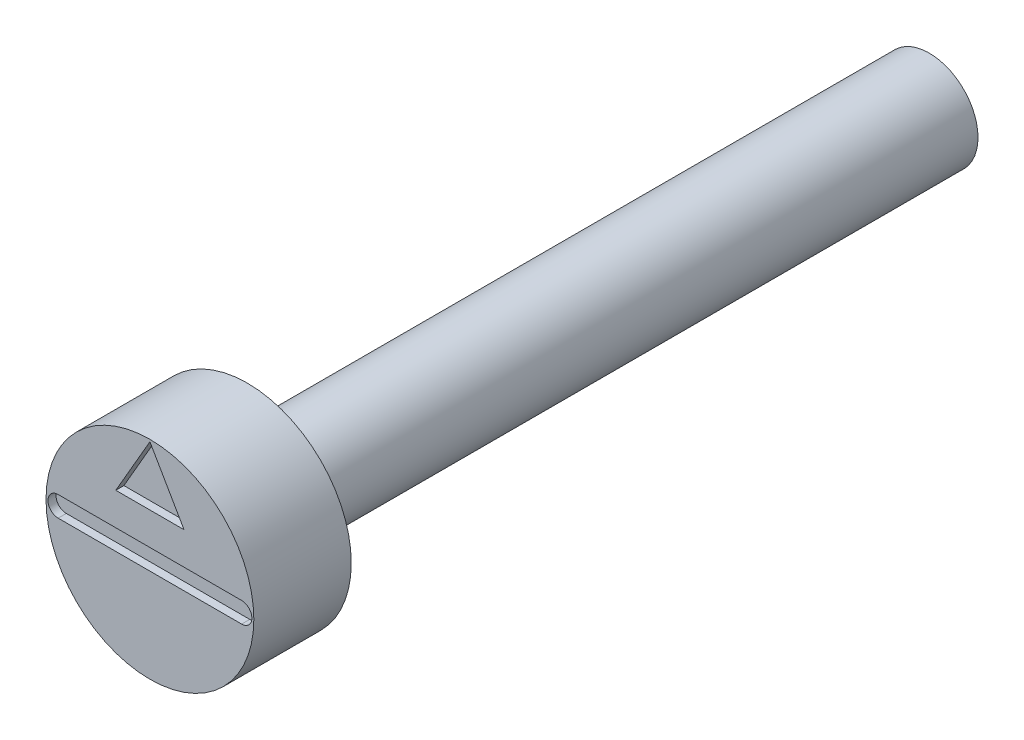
ISO-10303-21;
HEADER;
FILE_DESCRIPTION(('STEP AP214'),'2;1');
FILE_NAME('part.step','',(''),(''),'','','');
FILE_SCHEMA(('AUTOMOTIVE_DESIGN { 1 0 10303 214 1 1 1 1 }'));
ENDSEC;
DATA;
#1=APPLICATION_CONTEXT('core data for automotive mechanical design processes');
#2=APPLICATION_PROTOCOL_DEFINITION('international standard','automotive_design',2000,#1);
#3=PRODUCT_CONTEXT('',#1,'mechanical');
#4=PRODUCT('Part','Part','',(#3));
#5=PRODUCT_RELATED_PRODUCT_CATEGORY('part','',(#4));
#6=PRODUCT_DEFINITION_FORMATION('','',#4);
#7=PRODUCT_DEFINITION_CONTEXT('part definition',#1,'design');
#8=PRODUCT_DEFINITION('design','',#6,#7);
#9=PRODUCT_DEFINITION_SHAPE('','',#8);
#10=(LENGTH_UNIT() NAMED_UNIT(*) SI_UNIT(.MILLI.,.METRE.));
#11=(NAMED_UNIT(*) PLANE_ANGLE_UNIT() SI_UNIT($,.RADIAN.));
#12=(NAMED_UNIT(*) SI_UNIT($,.STERADIAN.) SOLID_ANGLE_UNIT());
#13=UNCERTAINTY_MEASURE_WITH_UNIT(LENGTH_MEASURE(1.E-05),#10,'distance_accuracy_value','');
#14=(GEOMETRIC_REPRESENTATION_CONTEXT(3) GLOBAL_UNCERTAINTY_ASSIGNED_CONTEXT((#13)) GLOBAL_UNIT_ASSIGNED_CONTEXT((#10,
#11,#12)) REPRESENTATION_CONTEXT('',''));
#15=CARTESIAN_POINT('',(0.,0.,0.));
#16=DIRECTION('',(0.,0.,1.));
#17=DIRECTION('',(1.,0.,0.));
#18=AXIS2_PLACEMENT_3D('',#15,#16,#17);
#19=CARTESIAN_POINT('',(1.59999680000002,0.,0.));
#20=DIRECTION('',(0.,0.,1.));
#21=DIRECTION('',(1.,0.,0.));
#22=AXIS2_PLACEMENT_3D('',#19,#20,#21);
#23=PLANE('',#22);
#24=CARTESIAN_POINT('',(-2.825,0.,0.));
#25=DIRECTION('',(0.,0.,1.));
#26=DIRECTION('',(1.,0.,0.));
#27=AXIS2_PLACEMENT_3D('',#24,#25,#26);
#28=CIRCLE('',#27,0.315);
#29=CARTESIAN_POINT('',(-2.825,0.315,0.));
#30=VERTEX_POINT('',#29);
#31=CARTESIAN_POINT('',(-2.825,-0.315,0.));
#32=VERTEX_POINT('',#31);
#33=EDGE_CURVE('E50',#30,#32,#28,.T.);
#34=ORIENTED_EDGE('',*,*,#33,.F.);
#35=DIRECTION('',(-1.,0.,0.));
#36=VECTOR('',#35,1.);
#37=CARTESIAN_POINT('',(-2.825,0.315,0.));
#38=LINE('',#37,#36);
#39=CARTESIAN_POINT('',(2.825,0.315,0.));
#40=VERTEX_POINT('',#39);
#41=EDGE_CURVE('E114',#40,#30,#38,.T.);
#42=ORIENTED_EDGE('',*,*,#41,.F.);
#43=CARTESIAN_POINT('',(2.825,0.,0.));
#44=DIRECTION('',(0.,0.,1.));
#45=DIRECTION('',(1.,0.,0.));
#46=AXIS2_PLACEMENT_3D('',#43,#44,#45);
#47=CIRCLE('',#46,0.315);
#48=CARTESIAN_POINT('',(2.825,-0.315,0.));
#49=VERTEX_POINT('',#48);
#50=EDGE_CURVE('E117',#49,#40,#47,.T.);
#51=ORIENTED_EDGE('',*,*,#50,.F.);
#52=DIRECTION('',(1.,0.,0.));
#53=VECTOR('',#52,1.);
#54=CARTESIAN_POINT('',(-2.825,-0.315,0.));
#55=LINE('',#54,#53);
#56=EDGE_CURVE('E123',#32,#49,#55,.T.);
#57=ORIENTED_EDGE('',*,*,#56,.F.);
#58=EDGE_LOOP('',(#34,#42,#51,#57));
#59=FACE_BOUND('',#58,.T.);
#60=DIRECTION('',(-0.499999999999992,0.866025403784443,0.));
#61=VECTOR('',#60,1.);
#62=CARTESIAN_POINT('',(1.0507774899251,1.315,0.));
#63=LINE('',#62,#61);
#64=CARTESIAN_POINT('',(1.0507774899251,1.315,0.));
#65=VERTEX_POINT('',#64);
#66=CARTESIAN_POINT('',(0.,3.135,0.));
#67=VERTEX_POINT('',#66);
#68=EDGE_CURVE('E58',#65,#67,#63,.T.);
#69=ORIENTED_EDGE('',*,*,#68,.F.);
#70=DIRECTION('',(1.,0.,0.));
#71=VECTOR('',#70,1.);
#72=CARTESIAN_POINT('',(-1.05077748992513,1.315,0.));
#73=LINE('',#72,#71);
#74=CARTESIAN_POINT('',(-1.05077748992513,1.315,0.));
#75=VERTEX_POINT('',#74);
#76=EDGE_CURVE('E136',#75,#65,#73,.T.);
#77=ORIENTED_EDGE('',*,*,#76,.F.);
#78=DIRECTION('',(-0.500000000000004,-0.866025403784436,0.));
#79=VECTOR('',#78,1.);
#80=CARTESIAN_POINT('',(0.,3.135,0.));
#81=LINE('',#80,#79);
#82=EDGE_CURVE('E144',#67,#75,#81,.T.);
#83=ORIENTED_EDGE('',*,*,#82,.F.);
#84=EDGE_LOOP('',(#69,#77,#83));
#85=FACE_BOUND('',#84,.T.);
#86=CARTESIAN_POINT('',(0.,0.,0.));
#87=DIRECTION('',(0.,0.,-1.));
#88=DIRECTION('',(-1.,0.,0.));
#89=AXIS2_PLACEMENT_3D('',#86,#87,#88);
#90=CIRCLE('',#89,3.1999936);
#91=CARTESIAN_POINT('',(-3.1999936,0.,0.));
#92=VERTEX_POINT('',#91);
#93=EDGE_CURVE('E39',#92,#92,#90,.T.);
#94=ORIENTED_EDGE('',*,*,#93,.F.);
#95=EDGE_LOOP('',(#94));
#96=FACE_BOUND('',#95,.T.);
#97=ADVANCED_FACE('F36',(#59,#85,#96),#23,.T.);
#98=CARTESIAN_POINT('',(0.,0.,-1.499997));
#99=DIRECTION('',(0.,0.,-1.));
#100=DIRECTION('',(-1.,0.,0.));
#101=AXIS2_PLACEMENT_3D('',#98,#99,#100);
#102=CYLINDRICAL_SURFACE('',#101,3.1999936);
#103=ORIENTED_EDGE('',*,*,#93,.T.);
#104=EDGE_LOOP('',(#103));
#105=FACE_BOUND('',#104,.T.);
#106=CARTESIAN_POINT('',(0.,0.,-2.999994));
#107=DIRECTION('',(0.,0.,-1.));
#108=DIRECTION('',(-1.,0.,0.));
#109=AXIS2_PLACEMENT_3D('',#106,#107,#108);
#110=CIRCLE('',#109,3.1999936);
#111=CARTESIAN_POINT('',(-3.1999936,0.,-2.999994));
#112=VERTEX_POINT('',#111);
#113=EDGE_CURVE('E11',#112,#112,#110,.T.);
#114=ORIENTED_EDGE('',*,*,#113,.F.);
#115=EDGE_LOOP('',(#114));
#116=FACE_BOUND('',#115,.T.);
#117=ADVANCED_FACE('F164',(#105,#116),#102,.T.);
#118=CARTESIAN_POINT('',(2.47499505,0.,-2.999994));
#119=DIRECTION('',(0.,0.,-1.));
#120=DIRECTION('',(-1.,0.,0.));
#121=AXIS2_PLACEMENT_3D('',#118,#119,#120);
#122=PLANE('',#121);
#123=ORIENTED_EDGE('',*,*,#113,.T.);
#124=EDGE_LOOP('',(#123));
#125=FACE_BOUND('',#124,.T.);
#126=CARTESIAN_POINT('',(-1.02838481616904E-13,0.,-2.99999400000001));
#127=DIRECTION('',(0.,0.,1.));
#128=DIRECTION('',(1.,0.,0.));
#129=AXIS2_PLACEMENT_3D('',#126,#127,#128);
#130=CIRCLE('',#129,1.50000000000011);
#131=CARTESIAN_POINT('',(1.5,0.,-2.999994));
#132=VERTEX_POINT('',#131);
#133=EDGE_CURVE('E157',#132,#132,#130,.T.);
#134=ORIENTED_EDGE('',*,*,#133,.T.);
#135=EDGE_LOOP('',(#134));
#136=FACE_BOUND('',#135,.T.);
#137=ADVANCED_FACE('F173',(#125,#136),#122,.T.);
#138=CARTESIAN_POINT('',(0.,0.,-23.999952));
#139=DIRECTION('',(0.,0.,1.));
#140=DIRECTION('',(1.,0.,0.));
#141=AXIS2_PLACEMENT_3D('',#138,#139,#140);
#142=CYLINDRICAL_SURFACE('',#141,1.50000000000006);
#143=ORIENTED_EDGE('',*,*,#133,.F.);
#144=EDGE_LOOP('',(#143));
#145=FACE_BOUND('',#144,.T.);
#146=CARTESIAN_POINT('',(0.,0.,-23.999952));
#147=DIRECTION('',(0.,0.,1.));
#148=DIRECTION('',(1.,0.,0.));
#149=AXIS2_PLACEMENT_3D('',#146,#147,#148);
#150=CIRCLE('',#149,1.50000000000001);
#151=CARTESIAN_POINT('',(1.5,0.,-23.999952));
#152=VERTEX_POINT('',#151);
#153=EDGE_CURVE('E151',#152,#152,#150,.T.);
#154=ORIENTED_EDGE('',*,*,#153,.T.);
#155=EDGE_LOOP('',(#154));
#156=FACE_BOUND('',#155,.T.);
#157=ADVANCED_FACE('F169',(#145,#156),#142,.T.);
#158=CARTESIAN_POINT('',(0.874998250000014,0.,-23.999952));
#159=DIRECTION('',(0.,0.,-1.));
#160=DIRECTION('',(-1.,0.,0.));
#161=AXIS2_PLACEMENT_3D('',#158,#159,#160);
#162=PLANE('',#161);
#163=ORIENTED_EDGE('',*,*,#153,.F.);
#164=EDGE_LOOP('',(#163));
#165=FACE_BOUND('',#164,.T.);
#166=ADVANCED_FACE('F176',(#165),#162,.T.);
#167=CARTESIAN_POINT('',(1.0507774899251,1.315,-0.25));
#168=DIRECTION('',(0.866025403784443,0.499999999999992,0.));
#169=DIRECTION('',(-0.499999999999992,0.866025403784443,0.));
#170=AXIS2_PLACEMENT_3D('',#167,#168,#169);
#171=PLANE('',#170);
#172=ORIENTED_EDGE('',*,*,#68,.T.);
#173=DIRECTION('',(0.,0.,1.));
#174=VECTOR('',#173,1.);
#175=CARTESIAN_POINT('',(0.,3.135,-0.25));
#176=LINE('',#175,#174);
#177=CARTESIAN_POINT('',(0.,3.135,-0.25));
#178=VERTEX_POINT('',#177);
#179=EDGE_CURVE('E142',#178,#67,#176,.T.);
#180=ORIENTED_EDGE('',*,*,#179,.F.);
#181=DIRECTION('',(-0.499999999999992,0.866025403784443,0.));
#182=VECTOR('',#181,1.);
#183=CARTESIAN_POINT('',(1.0507774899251,1.315,-0.25));
#184=LINE('',#183,#182);
#185=CARTESIAN_POINT('',(1.0507774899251,1.315,-0.25));
#186=VERTEX_POINT('',#185);
#187=EDGE_CURVE('E132',#186,#178,#184,.T.);
#188=ORIENTED_EDGE('',*,*,#187,.F.);
#189=DIRECTION('',(0.,0.,1.));
#190=VECTOR('',#189,1.);
#191=CARTESIAN_POINT('',(1.0507774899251,1.315,-0.25));
#192=LINE('',#191,#190);
#193=EDGE_CURVE('E149',#186,#65,#192,.T.);
#194=ORIENTED_EDGE('',*,*,#193,.T.);
#195=EDGE_LOOP('',(#172,#180,#188,#194));
#196=FACE_BOUND('',#195,.T.);
#197=ADVANCED_FACE('F186',(#196),#171,.F.);
#198=CARTESIAN_POINT('',(-1.05077748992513,1.315,-0.25));
#199=DIRECTION('',(0.,-1.,0.));
#200=DIRECTION('',(1.,0.,0.));
#201=AXIS2_PLACEMENT_3D('',#198,#199,#200);
#202=PLANE('',#201);
#203=ORIENTED_EDGE('',*,*,#76,.T.);
#204=ORIENTED_EDGE('',*,*,#193,.F.);
#205=DIRECTION('',(1.,0.,0.));
#206=VECTOR('',#205,1.);
#207=CARTESIAN_POINT('',(-1.05077748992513,1.315,-0.25));
#208=LINE('',#207,#206);
#209=CARTESIAN_POINT('',(-1.05077748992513,1.315,-0.25));
#210=VERTEX_POINT('',#209);
#211=EDGE_CURVE('E139',#210,#186,#208,.T.);
#212=ORIENTED_EDGE('',*,*,#211,.F.);
#213=DIRECTION('',(0.,0.,1.));
#214=VECTOR('',#213,1.);
#215=CARTESIAN_POINT('',(-1.05077748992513,1.315,-0.25));
#216=LINE('',#215,#214);
#217=EDGE_CURVE('E152',#210,#75,#216,.T.);
#218=ORIENTED_EDGE('',*,*,#217,.T.);
#219=EDGE_LOOP('',(#203,#204,#212,#218));
#220=FACE_BOUND('',#219,.T.);
#221=ADVANCED_FACE('F191',(#220),#202,.F.);
#222=CARTESIAN_POINT('',(0.,3.135,-0.25));
#223=DIRECTION('',(-0.866025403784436,0.500000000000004,0.));
#224=DIRECTION('',(-0.500000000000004,-0.866025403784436,0.));
#225=AXIS2_PLACEMENT_3D('',#222,#223,#224);
#226=PLANE('',#225);
#227=ORIENTED_EDGE('',*,*,#82,.T.);
#228=ORIENTED_EDGE('',*,*,#217,.F.);
#229=DIRECTION('',(-0.500000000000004,-0.866025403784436,0.));
#230=VECTOR('',#229,1.);
#231=CARTESIAN_POINT('',(0.,3.135,-0.25));
#232=LINE('',#231,#230);
#233=EDGE_CURVE('E135',#178,#210,#232,.T.);
#234=ORIENTED_EDGE('',*,*,#233,.F.);
#235=ORIENTED_EDGE('',*,*,#179,.T.);
#236=EDGE_LOOP('',(#227,#228,#234,#235));
#237=FACE_BOUND('',#236,.T.);
#238=ADVANCED_FACE('F192',(#237),#226,.F.);
#239=CARTESIAN_POINT('',(0.,0.,-0.25));
#240=DIRECTION('',(0.,0.,1.));
#241=DIRECTION('',(1.,0.,0.));
#242=AXIS2_PLACEMENT_3D('',#239,#240,#241);
#243=PLANE('',#242);
#244=ORIENTED_EDGE('',*,*,#187,.T.);
#245=ORIENTED_EDGE('',*,*,#233,.T.);
#246=ORIENTED_EDGE('',*,*,#211,.T.);
#247=EDGE_LOOP('',(#244,#245,#246));
#248=FACE_BOUND('',#247,.T.);
#249=ADVANCED_FACE('F195',(#248),#243,.T.);
#250=CARTESIAN_POINT('',(-2.825,0.,-0.25));
#251=DIRECTION('',(0.,0.,1.));
#252=DIRECTION('',(1.,0.,0.));
#253=AXIS2_PLACEMENT_3D('',#250,#251,#252);
#254=CYLINDRICAL_SURFACE('',#253,0.315);
#255=ORIENTED_EDGE('',*,*,#33,.T.);
#256=DIRECTION('',(0.,0.,1.));
#257=VECTOR('',#256,1.);
#258=CARTESIAN_POINT('',(-2.825,-0.315,-0.25));
#259=LINE('',#258,#257);
#260=CARTESIAN_POINT('',(-2.825,-0.315,-0.25));
#261=VERTEX_POINT('',#260);
#262=EDGE_CURVE('E92',#261,#32,#259,.T.);
#263=ORIENTED_EDGE('',*,*,#262,.F.);
#264=CARTESIAN_POINT('',(-2.825,0.,-0.25));
#265=DIRECTION('',(0.,0.,1.));
#266=DIRECTION('',(1.,0.,0.));
#267=AXIS2_PLACEMENT_3D('',#264,#265,#266);
#268=CIRCLE('',#267,0.315);
#269=CARTESIAN_POINT('',(-2.825,0.315,-0.25));
#270=VERTEX_POINT('',#269);
#271=EDGE_CURVE('E96',#270,#261,#268,.T.);
#272=ORIENTED_EDGE('',*,*,#271,.F.);
#273=DIRECTION('',(0.,0.,1.));
#274=VECTOR('',#273,1.);
#275=CARTESIAN_POINT('',(-2.825,0.315,-0.25));
#276=LINE('',#275,#274);
#277=EDGE_CURVE('E127',#270,#30,#276,.T.);
#278=ORIENTED_EDGE('',*,*,#277,.T.);
#279=EDGE_LOOP('',(#255,#263,#272,#278));
#280=FACE_BOUND('',#279,.T.);
#281=ADVANCED_FACE('F94',(#280),#254,.F.);
#282=CARTESIAN_POINT('',(-2.825,0.315,-0.25));
#283=DIRECTION('',(0.,1.,0.));
#284=DIRECTION('',(-1.,0.,0.));
#285=AXIS2_PLACEMENT_3D('',#282,#283,#284);
#286=PLANE('',#285);
#287=ORIENTED_EDGE('',*,*,#41,.T.);
#288=ORIENTED_EDGE('',*,*,#277,.F.);
#289=DIRECTION('',(-1.,0.,0.));
#290=VECTOR('',#289,1.);
#291=CARTESIAN_POINT('',(-2.825,0.315,-0.25));
#292=LINE('',#291,#290);
#293=CARTESIAN_POINT('',(2.825,0.315,-0.25));
#294=VERTEX_POINT('',#293);
#295=EDGE_CURVE('E102',#294,#270,#292,.T.);
#296=ORIENTED_EDGE('',*,*,#295,.F.);
#297=DIRECTION('',(0.,0.,1.));
#298=VECTOR('',#297,1.);
#299=CARTESIAN_POINT('',(2.825,0.315,-0.25));
#300=LINE('',#299,#298);
#301=EDGE_CURVE('E129',#294,#40,#300,.T.);
#302=ORIENTED_EDGE('',*,*,#301,.T.);
#303=EDGE_LOOP('',(#287,#288,#296,#302));
#304=FACE_BOUND('',#303,.T.);
#305=ADVANCED_FACE('F205',(#304),#286,.F.);
#306=CARTESIAN_POINT('',(2.825,0.,-0.25));
#307=DIRECTION('',(0.,0.,1.));
#308=DIRECTION('',(1.,0.,0.));
#309=AXIS2_PLACEMENT_3D('',#306,#307,#308);
#310=CYLINDRICAL_SURFACE('',#309,0.315);
#311=ORIENTED_EDGE('',*,*,#50,.T.);
#312=ORIENTED_EDGE('',*,*,#301,.F.);
#313=CARTESIAN_POINT('',(2.825,0.,-0.25));
#314=DIRECTION('',(0.,0.,1.));
#315=DIRECTION('',(1.,0.,0.));
#316=AXIS2_PLACEMENT_3D('',#313,#314,#315);
#317=CIRCLE('',#316,0.315);
#318=CARTESIAN_POINT('',(2.825,-0.315,-0.25));
#319=VERTEX_POINT('',#318);
#320=EDGE_CURVE('E110',#319,#294,#317,.T.);
#321=ORIENTED_EDGE('',*,*,#320,.F.);
#322=DIRECTION('',(0.,0.,1.));
#323=VECTOR('',#322,1.);
#324=CARTESIAN_POINT('',(2.825,-0.315,-0.25));
#325=LINE('',#324,#323);
#326=EDGE_CURVE('E101',#319,#49,#325,.T.);
#327=ORIENTED_EDGE('',*,*,#326,.T.);
#328=EDGE_LOOP('',(#311,#312,#321,#327));
#329=FACE_BOUND('',#328,.T.);
#330=ADVANCED_FACE('F208',(#329),#310,.F.);
#331=CARTESIAN_POINT('',(-2.825,-0.315,-0.25));
#332=DIRECTION('',(0.,-1.,0.));
#333=DIRECTION('',(1.,0.,0.));
#334=AXIS2_PLACEMENT_3D('',#331,#332,#333);
#335=PLANE('',#334);
#336=ORIENTED_EDGE('',*,*,#56,.T.);
#337=ORIENTED_EDGE('',*,*,#326,.F.);
#338=DIRECTION('',(1.,0.,0.));
#339=VECTOR('',#338,1.);
#340=CARTESIAN_POINT('',(-2.825,-0.315,-0.25));
#341=LINE('',#340,#339);
#342=EDGE_CURVE('E105',#261,#319,#341,.T.);
#343=ORIENTED_EDGE('',*,*,#342,.F.);
#344=ORIENTED_EDGE('',*,*,#262,.T.);
#345=EDGE_LOOP('',(#336,#337,#343,#344));
#346=FACE_BOUND('',#345,.T.);
#347=ADVANCED_FACE('F106',(#346),#335,.F.);
#348=CARTESIAN_POINT('',(-2.825,0.,-0.25));
#349=DIRECTION('',(0.,0.,1.));
#350=DIRECTION('',(1.,0.,0.));
#351=AXIS2_PLACEMENT_3D('',#348,#349,#350);
#352=PLANE('',#351);
#353=ORIENTED_EDGE('',*,*,#271,.T.);
#354=ORIENTED_EDGE('',*,*,#342,.T.);
#355=ORIENTED_EDGE('',*,*,#320,.T.);
#356=ORIENTED_EDGE('',*,*,#295,.T.);
#357=EDGE_LOOP('',(#353,#354,#355,#356));
#358=FACE_BOUND('',#357,.T.);
#359=ADVANCED_FACE('F112',(#358),#352,.T.);
#360=CLOSED_SHELL('',(#97,#117,#137,#157,#166,#197,#221,#238,#249,#281,#305,#330,#347,#359));
#361=MANIFOLD_SOLID_BREP('B2',#360);
#362=ADVANCED_BREP_SHAPE_REPRESENTATION('',(#18,#361),#14);
#363=SHAPE_DEFINITION_REPRESENTATION(#9,#362);
ENDSEC;
END-ISO-10303-21;
